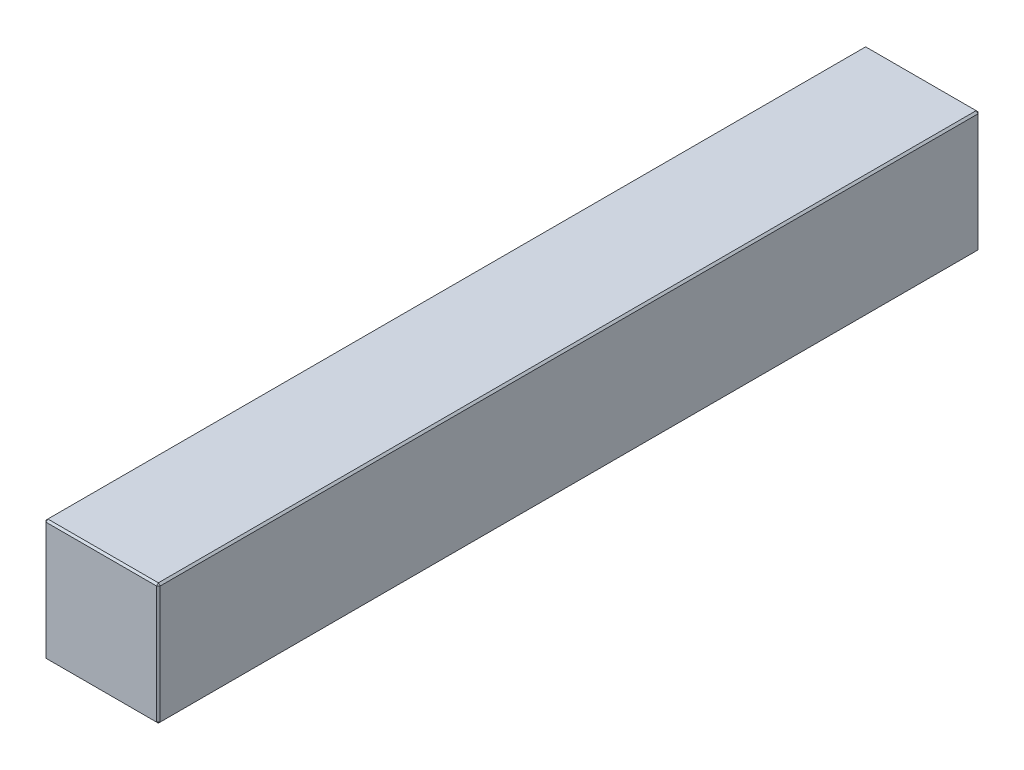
ISO-10303-21;
HEADER;
FILE_DESCRIPTION(('STEP AP214'),'2;1');
FILE_NAME('part.step','',(''),(''),'','','');
FILE_SCHEMA(('AUTOMOTIVE_DESIGN { 1 0 10303 214 1 1 1 1 }'));
ENDSEC;
DATA;
#1=APPLICATION_CONTEXT('core data for automotive mechanical design processes');
#2=APPLICATION_PROTOCOL_DEFINITION('international standard','automotive_design',2000,#1);
#3=PRODUCT_CONTEXT('',#1,'mechanical');
#4=PRODUCT('Part','Part','',(#3));
#5=PRODUCT_RELATED_PRODUCT_CATEGORY('part','',(#4));
#6=PRODUCT_DEFINITION_FORMATION('','',#4);
#7=PRODUCT_DEFINITION_CONTEXT('part definition',#1,'design');
#8=PRODUCT_DEFINITION('design','',#6,#7);
#9=PRODUCT_DEFINITION_SHAPE('','',#8);
#10=(LENGTH_UNIT() NAMED_UNIT(*) SI_UNIT(.MILLI.,.METRE.));
#11=(NAMED_UNIT(*) PLANE_ANGLE_UNIT() SI_UNIT($,.RADIAN.));
#12=(NAMED_UNIT(*) SI_UNIT($,.STERADIAN.) SOLID_ANGLE_UNIT());
#13=UNCERTAINTY_MEASURE_WITH_UNIT(LENGTH_MEASURE(1.E-05),#10,'distance_accuracy_value','');
#14=(GEOMETRIC_REPRESENTATION_CONTEXT(3) GLOBAL_UNCERTAINTY_ASSIGNED_CONTEXT((#13)) GLOBAL_UNIT_ASSIGNED_CONTEXT((#10,
#11,#12)) REPRESENTATION_CONTEXT('',''));
#15=CARTESIAN_POINT('',(0.,0.,0.));
#16=DIRECTION('',(0.,0.,1.));
#17=DIRECTION('',(1.,0.,0.));
#18=AXIS2_PLACEMENT_3D('',#15,#16,#17);
#19=CARTESIAN_POINT('',(-31.,66.,223.));
#20=DIRECTION('',(1.,0.,0.));
#21=DIRECTION('',(0.,0.,-1.));
#22=AXIS2_PLACEMENT_3D('',#19,#20,#21);
#23=PLANE('',#22);
#24=DIRECTION('',(0.,-1.,0.));
#25=VECTOR('',#24,1.);
#26=CARTESIAN_POINT('',(-31.,66.,-222.));
#27=LINE('',#26,#25);
#28=CARTESIAN_POINT('',(-31.,65.,-222.));
#29=VERTEX_POINT('',#28);
#30=CARTESIAN_POINT('',(-31.,1.00000000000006,-222.));
#31=VERTEX_POINT('',#30);
#32=EDGE_CURVE('E115',#29,#31,#27,.T.);
#33=ORIENTED_EDGE('',*,*,#32,.T.);
#34=DIRECTION('',(0.,0.,1.));
#35=VECTOR('',#34,1.);
#36=CARTESIAN_POINT('',(-31.,1.00000000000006,223.));
#37=LINE('',#36,#35);
#38=CARTESIAN_POINT('',(-31.,1.00000000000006,222.));
#39=VERTEX_POINT('',#38);
#40=EDGE_CURVE('E111',#31,#39,#37,.T.);
#41=ORIENTED_EDGE('',*,*,#40,.T.);
#42=DIRECTION('',(0.,1.,0.));
#43=VECTOR('',#42,1.);
#44=CARTESIAN_POINT('',(-31.,66.,222.));
#45=LINE('',#44,#43);
#46=CARTESIAN_POINT('',(-31.,65.,222.));
#47=VERTEX_POINT('',#46);
#48=EDGE_CURVE('E104',#39,#47,#45,.T.);
#49=ORIENTED_EDGE('',*,*,#48,.T.);
#50=DIRECTION('',(0.,0.,-1.));
#51=VECTOR('',#50,1.);
#52=CARTESIAN_POINT('',(-31.,65.,-223.));
#53=LINE('',#52,#51);
#54=EDGE_CURVE('E108',#47,#29,#53,.T.);
#55=ORIENTED_EDGE('',*,*,#54,.T.);
#56=EDGE_LOOP('',(#33,#41,#49,#55));
#57=FACE_BOUND('',#56,.T.);
#58=ADVANCED_FACE('F16',(#57),#23,.F.);
#59=CARTESIAN_POINT('',(31.,66.,223.));
#60=DIRECTION('',(0.,0.,-1.));
#61=DIRECTION('',(-1.,0.,0.));
#62=AXIS2_PLACEMENT_3D('',#59,#60,#61);
#63=PLANE('',#62);
#64=DIRECTION('',(-1.,0.,0.));
#65=VECTOR('',#64,1.);
#66=CARTESIAN_POINT('',(-31.,65.,223.));
#67=LINE('',#66,#65);
#68=CARTESIAN_POINT('',(30.,65.,223.));
#69=VERTEX_POINT('',#68);
#70=CARTESIAN_POINT('',(-30.,65.,223.));
#71=VERTEX_POINT('',#70);
#72=EDGE_CURVE('E165',#69,#71,#67,.T.);
#73=ORIENTED_EDGE('',*,*,#72,.T.);
#74=DIRECTION('',(0.,-1.,0.));
#75=VECTOR('',#74,1.);
#76=CARTESIAN_POINT('',(-30.,66.,223.));
#77=LINE('',#76,#75);
#78=CARTESIAN_POINT('',(-30.,1.00000000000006,223.));
#79=VERTEX_POINT('',#78);
#80=EDGE_CURVE('E123',#71,#79,#77,.T.);
#81=ORIENTED_EDGE('',*,*,#80,.T.);
#82=DIRECTION('',(1.,0.,0.));
#83=VECTOR('',#82,1.);
#84=CARTESIAN_POINT('',(31.,1.00000000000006,223.));
#85=LINE('',#84,#83);
#86=CARTESIAN_POINT('',(30.,1.00000000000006,223.));
#87=VERTEX_POINT('',#86);
#88=EDGE_CURVE('E169',#79,#87,#85,.T.);
#89=ORIENTED_EDGE('',*,*,#88,.T.);
#90=DIRECTION('',(0.,1.,0.));
#91=VECTOR('',#90,1.);
#92=CARTESIAN_POINT('',(30.,66.,223.));
#93=LINE('',#92,#91);
#94=EDGE_CURVE('E167',#87,#69,#93,.T.);
#95=ORIENTED_EDGE('',*,*,#94,.T.);
#96=EDGE_LOOP('',(#73,#81,#89,#95));
#97=FACE_BOUND('',#96,.T.);
#98=ADVANCED_FACE('F276',(#97),#63,.F.);
#99=CARTESIAN_POINT('',(31.,66.,223.));
#100=DIRECTION('',(-1.,0.,0.));
#101=DIRECTION('',(0.,0.,1.));
#102=AXIS2_PLACEMENT_3D('',#99,#100,#101);
#103=PLANE('',#102);
#104=DIRECTION('',(0.,0.,-1.));
#105=VECTOR('',#104,1.);
#106=CARTESIAN_POINT('',(31.,1.00000000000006,223.));
#107=LINE('',#106,#105);
#108=CARTESIAN_POINT('',(31.,1.00000000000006,222.));
#109=VERTEX_POINT('',#108);
#110=CARTESIAN_POINT('',(31.,1.00000000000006,-222.));
#111=VERTEX_POINT('',#110);
#112=EDGE_CURVE('E160',#109,#111,#107,.T.);
#113=ORIENTED_EDGE('',*,*,#112,.T.);
#114=DIRECTION('',(0.,1.,0.));
#115=VECTOR('',#114,1.);
#116=CARTESIAN_POINT('',(31.,66.,-222.));
#117=LINE('',#116,#115);
#118=CARTESIAN_POINT('',(31.,65.,-222.));
#119=VERTEX_POINT('',#118);
#120=EDGE_CURVE('E162',#111,#119,#117,.T.);
#121=ORIENTED_EDGE('',*,*,#120,.T.);
#122=DIRECTION('',(0.,0.,1.));
#123=VECTOR('',#122,1.);
#124=CARTESIAN_POINT('',(31.,65.,223.));
#125=LINE('',#124,#123);
#126=CARTESIAN_POINT('',(31.,65.,222.));
#127=VERTEX_POINT('',#126);
#128=EDGE_CURVE('E156',#119,#127,#125,.T.);
#129=ORIENTED_EDGE('',*,*,#128,.T.);
#130=DIRECTION('',(0.,-1.,0.));
#131=VECTOR('',#130,1.);
#132=CARTESIAN_POINT('',(31.,66.,222.));
#133=LINE('',#132,#131);
#134=EDGE_CURVE('E158',#127,#109,#133,.T.);
#135=ORIENTED_EDGE('',*,*,#134,.T.);
#136=EDGE_LOOP('',(#113,#121,#129,#135));
#137=FACE_BOUND('',#136,.T.);
#138=ADVANCED_FACE('F255',(#137),#103,.F.);
#139=CARTESIAN_POINT('',(31.,66.,-223.));
#140=DIRECTION('',(0.,0.,1.));
#141=DIRECTION('',(1.,0.,0.));
#142=AXIS2_PLACEMENT_3D('',#139,#140,#141);
#143=PLANE('',#142);
#144=DIRECTION('',(0.,-1.,0.));
#145=VECTOR('',#144,1.);
#146=CARTESIAN_POINT('',(30.,66.,-223.));
#147=LINE('',#146,#145);
#148=CARTESIAN_POINT('',(30.,65.,-223.));
#149=VERTEX_POINT('',#148);
#150=CARTESIAN_POINT('',(30.,1.00000000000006,-223.));
#151=VERTEX_POINT('',#150);
#152=EDGE_CURVE('E149',#149,#151,#147,.T.);
#153=ORIENTED_EDGE('',*,*,#152,.T.);
#154=DIRECTION('',(-1.,0.,0.));
#155=VECTOR('',#154,1.);
#156=CARTESIAN_POINT('',(31.,1.00000000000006,-223.));
#157=LINE('',#156,#155);
#158=CARTESIAN_POINT('',(-30.,1.00000000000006,-223.));
#159=VERTEX_POINT('',#158);
#160=EDGE_CURVE('E154',#151,#159,#157,.T.);
#161=ORIENTED_EDGE('',*,*,#160,.T.);
#162=DIRECTION('',(0.,1.,0.));
#163=VECTOR('',#162,1.);
#164=CARTESIAN_POINT('',(-30.,66.,-223.));
#165=LINE('',#164,#163);
#166=CARTESIAN_POINT('',(-30.,65.,-223.));
#167=VERTEX_POINT('',#166);
#168=EDGE_CURVE('E151',#159,#167,#165,.T.);
#169=ORIENTED_EDGE('',*,*,#168,.T.);
#170=DIRECTION('',(1.,0.,0.));
#171=VECTOR('',#170,1.);
#172=CARTESIAN_POINT('',(31.,65.,-223.));
#173=LINE('',#172,#171);
#174=EDGE_CURVE('E147',#167,#149,#173,.T.);
#175=ORIENTED_EDGE('',*,*,#174,.T.);
#176=EDGE_LOOP('',(#153,#161,#169,#175));
#177=FACE_BOUND('',#176,.T.);
#178=ADVANCED_FACE('F285',(#177),#143,.F.);
#179=CARTESIAN_POINT('',(0.,66.,0.));
#180=DIRECTION('',(0.,1.,0.));
#181=DIRECTION('',(0.,0.,1.));
#182=AXIS2_PLACEMENT_3D('',#179,#180,#181);
#183=PLANE('',#182);
#184=DIRECTION('',(0.,0.,-1.));
#185=VECTOR('',#184,1.);
#186=CARTESIAN_POINT('',(30.,66.,-223.));
#187=LINE('',#186,#185);
#188=CARTESIAN_POINT('',(30.,66.,222.));
#189=VERTEX_POINT('',#188);
#190=CARTESIAN_POINT('',(30.,66.,-222.));
#191=VERTEX_POINT('',#190);
#192=EDGE_CURVE('E25',#189,#191,#187,.T.);
#193=ORIENTED_EDGE('',*,*,#192,.T.);
#194=DIRECTION('',(-1.,0.,0.));
#195=VECTOR('',#194,1.);
#196=CARTESIAN_POINT('',(-31.,66.,-222.));
#197=LINE('',#196,#195);
#198=CARTESIAN_POINT('',(-30.,66.,-222.));
#199=VERTEX_POINT('',#198);
#200=EDGE_CURVE('E10',#191,#199,#197,.T.);
#201=ORIENTED_EDGE('',*,*,#200,.T.);
#202=DIRECTION('',(0.,0.,1.));
#203=VECTOR('',#202,1.);
#204=CARTESIAN_POINT('',(-30.,66.,223.));
#205=LINE('',#204,#203);
#206=CARTESIAN_POINT('',(-30.,66.,222.));
#207=VERTEX_POINT('',#206);
#208=EDGE_CURVE('E181',#199,#207,#205,.T.);
#209=ORIENTED_EDGE('',*,*,#208,.T.);
#210=DIRECTION('',(1.,0.,0.));
#211=VECTOR('',#210,1.);
#212=CARTESIAN_POINT('',(31.,66.,222.));
#213=LINE('',#212,#211);
#214=EDGE_CURVE('E36',#207,#189,#213,.T.);
#215=ORIENTED_EDGE('',*,*,#214,.T.);
#216=EDGE_LOOP('',(#193,#201,#209,#215));
#217=FACE_BOUND('',#216,.T.);
#218=ADVANCED_FACE('F351',(#217),#183,.T.);
#219=CARTESIAN_POINT('',(0.,0.,0.));
#220=DIRECTION('',(0.,1.,0.));
#221=DIRECTION('',(0.,0.,1.));
#222=AXIS2_PLACEMENT_3D('',#219,#220,#221);
#223=PLANE('',#222);
#224=DIRECTION('',(0.,0.,1.));
#225=VECTOR('',#224,1.);
#226=CARTESIAN_POINT('',(30.,0.,0.));
#227=LINE('',#226,#225);
#228=CARTESIAN_POINT('',(30.,0.,-222.));
#229=VERTEX_POINT('',#228);
#230=CARTESIAN_POINT('',(30.,0.,222.));
#231=VERTEX_POINT('',#230);
#232=EDGE_CURVE('E172',#229,#231,#227,.T.);
#233=ORIENTED_EDGE('',*,*,#232,.T.);
#234=DIRECTION('',(-1.,0.,0.));
#235=VECTOR('',#234,1.);
#236=CARTESIAN_POINT('',(0.,0.,222.));
#237=LINE('',#236,#235);
#238=CARTESIAN_POINT('',(-30.,0.,222.));
#239=VERTEX_POINT('',#238);
#240=EDGE_CURVE('E178',#231,#239,#237,.T.);
#241=ORIENTED_EDGE('',*,*,#240,.T.);
#242=DIRECTION('',(0.,0.,-1.));
#243=VECTOR('',#242,1.);
#244=CARTESIAN_POINT('',(-30.,0.,0.));
#245=LINE('',#244,#243);
#246=CARTESIAN_POINT('',(-30.,0.,-222.));
#247=VERTEX_POINT('',#246);
#248=EDGE_CURVE('E176',#239,#247,#245,.T.);
#249=ORIENTED_EDGE('',*,*,#248,.T.);
#250=DIRECTION('',(1.,0.,0.));
#251=VECTOR('',#250,1.);
#252=CARTESIAN_POINT('',(0.,0.,-222.));
#253=LINE('',#252,#251);
#254=EDGE_CURVE('E174',#247,#229,#253,.T.);
#255=ORIENTED_EDGE('',*,*,#254,.T.);
#256=EDGE_LOOP('',(#233,#241,#249,#255));
#257=FACE_BOUND('',#256,.T.);
#258=ADVANCED_FACE('F247',(#257),#223,.F.);
#259=CARTESIAN_POINT('',(31.,66.,222.));
#260=DIRECTION('',(-0.707106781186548,0.,-0.707106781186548));
#261=DIRECTION('',(0.,-1.,0.));
#262=AXIS2_PLACEMENT_3D('',#259,#260,#261);
#263=PLANE('',#262);
#264=DIRECTION('',(-0.707106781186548,0.,0.707106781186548));
#265=VECTOR('',#264,1.);
#266=CARTESIAN_POINT('',(30.,65.,223.));
#267=LINE('',#266,#265);
#268=EDGE_CURVE('E20',#69,#127,#267,.F.);
#269=ORIENTED_EDGE('',*,*,#268,.F.);
#270=ORIENTED_EDGE('',*,*,#94,.F.);
#271=DIRECTION('',(0.707106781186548,0.,-0.707106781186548));
#272=VECTOR('',#271,1.);
#273=CARTESIAN_POINT('',(30.,1.00000000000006,223.));
#274=LINE('',#273,#272);
#275=EDGE_CURVE('E143',#109,#87,#274,.F.);
#276=ORIENTED_EDGE('',*,*,#275,.F.);
#277=ORIENTED_EDGE('',*,*,#134,.F.);
#278=EDGE_LOOP('',(#269,#270,#276,#277));
#279=FACE_BOUND('',#278,.T.);
#280=ADVANCED_FACE('F18',(#279),#263,.F.);
#281=CARTESIAN_POINT('',(30.,65.,223.));
#282=DIRECTION('',(0.577350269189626,0.577350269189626,0.577350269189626));
#283=DIRECTION('',(0.707106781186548,0.,-0.707106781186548));
#284=AXIS2_PLACEMENT_3D('',#281,#282,#283);
#285=PLANE('',#284);
#286=DIRECTION('',(0.,-0.707106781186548,0.707106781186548));
#287=VECTOR('',#286,1.);
#288=CARTESIAN_POINT('',(30.,65.,223.));
#289=LINE('',#288,#287);
#290=EDGE_CURVE('E227',#69,#189,#289,.F.);
#291=ORIENTED_EDGE('',*,*,#290,.F.);
#292=ORIENTED_EDGE('',*,*,#268,.T.);
#293=DIRECTION('',(-0.707106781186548,0.707106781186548,0.));
#294=VECTOR('',#293,1.);
#295=CARTESIAN_POINT('',(30.5,65.5,222.));
#296=LINE('',#295,#294);
#297=EDGE_CURVE('E229',#189,#127,#296,.F.);
#298=ORIENTED_EDGE('',*,*,#297,.F.);
#299=EDGE_LOOP('',(#291,#292,#298));
#300=FACE_BOUND('',#299,.T.);
#301=ADVANCED_FACE('F271',(#300),#285,.T.);
#302=CARTESIAN_POINT('',(30.,1.00000000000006,223.));
#303=DIRECTION('',(0.577350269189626,-0.577350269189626,0.577350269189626));
#304=DIRECTION('',(0.707106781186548,0.,-0.707106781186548));
#305=AXIS2_PLACEMENT_3D('',#302,#303,#304);
#306=PLANE('',#305);
#307=DIRECTION('',(-0.707106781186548,-0.707106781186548,0.));
#308=VECTOR('',#307,1.);
#309=CARTESIAN_POINT('',(30.5,0.500000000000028,222.));
#310=LINE('',#309,#308);
#311=EDGE_CURVE('E221',#109,#231,#310,.T.);
#312=ORIENTED_EDGE('',*,*,#311,.F.);
#313=ORIENTED_EDGE('',*,*,#275,.T.);
#314=DIRECTION('',(0.,0.707106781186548,0.707106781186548));
#315=VECTOR('',#314,1.);
#316=CARTESIAN_POINT('',(30.,1.00000000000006,223.));
#317=LINE('',#316,#315);
#318=EDGE_CURVE('E224',#231,#87,#317,.T.);
#319=ORIENTED_EDGE('',*,*,#318,.F.);
#320=EDGE_LOOP('',(#312,#313,#319));
#321=FACE_BOUND('',#320,.T.);
#322=ADVANCED_FACE('F236',(#321),#306,.T.);
#323=CARTESIAN_POINT('',(30.,66.,0.));
#324=DIRECTION('',(0.707106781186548,0.707106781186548,0.));
#325=DIRECTION('',(0.,0.,1.));
#326=AXIS2_PLACEMENT_3D('',#323,#324,#325);
#327=PLANE('',#326);
#328=ORIENTED_EDGE('',*,*,#297,.T.);
#329=ORIENTED_EDGE('',*,*,#128,.F.);
#330=DIRECTION('',(0.707106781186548,-0.707106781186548,0.));
#331=VECTOR('',#330,1.);
#332=CARTESIAN_POINT('',(31.,65.,-222.));
#333=LINE('',#332,#331);
#334=EDGE_CURVE('E216',#191,#119,#333,.T.);
#335=ORIENTED_EDGE('',*,*,#334,.F.);
#336=ORIENTED_EDGE('',*,*,#192,.F.);
#337=EDGE_LOOP('',(#328,#329,#335,#336));
#338=FACE_BOUND('',#337,.T.);
#339=ADVANCED_FACE('F266',(#338),#327,.T.);
#340=CARTESIAN_POINT('',(0.,66.,222.));
#341=DIRECTION('',(0.,0.707106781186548,0.707106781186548));
#342=DIRECTION('',(-1.,0.,0.));
#343=AXIS2_PLACEMENT_3D('',#340,#341,#342);
#344=PLANE('',#343);
#345=ORIENTED_EDGE('',*,*,#290,.T.);
#346=ORIENTED_EDGE('',*,*,#214,.F.);
#347=DIRECTION('',(0.,0.707106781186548,-0.707106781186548));
#348=VECTOR('',#347,1.);
#349=CARTESIAN_POINT('',(-30.,65.5,222.5));
#350=LINE('',#349,#348);
#351=EDGE_CURVE('E127',#71,#207,#350,.T.);
#352=ORIENTED_EDGE('',*,*,#351,.F.);
#353=ORIENTED_EDGE('',*,*,#72,.F.);
#354=EDGE_LOOP('',(#345,#346,#352,#353));
#355=FACE_BOUND('',#354,.T.);
#356=ADVANCED_FACE('F274',(#355),#344,.T.);
#357=CARTESIAN_POINT('',(-30.,66.,223.));
#358=DIRECTION('',(0.707106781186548,0.,-0.707106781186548));
#359=DIRECTION('',(0.,-1.,0.));
#360=AXIS2_PLACEMENT_3D('',#357,#358,#359);
#361=PLANE('',#360);
#362=DIRECTION('',(0.707106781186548,0.,0.707106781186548));
#363=VECTOR('',#362,1.);
#364=CARTESIAN_POINT('',(-30.,1.00000000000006,223.));
#365=LINE('',#364,#363);
#366=EDGE_CURVE('E128',#79,#39,#365,.F.);
#367=ORIENTED_EDGE('',*,*,#366,.F.);
#368=ORIENTED_EDGE('',*,*,#80,.F.);
#369=DIRECTION('',(-0.707106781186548,0.,-0.707106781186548));
#370=VECTOR('',#369,1.);
#371=CARTESIAN_POINT('',(-31.,65.,222.));
#372=LINE('',#371,#370);
#373=EDGE_CURVE('E119',#47,#71,#372,.F.);
#374=ORIENTED_EDGE('',*,*,#373,.F.);
#375=ORIENTED_EDGE('',*,*,#48,.F.);
#376=EDGE_LOOP('',(#367,#368,#374,#375));
#377=FACE_BOUND('',#376,.T.);
#378=ADVANCED_FACE('F121',(#377),#361,.F.);
#379=CARTESIAN_POINT('',(31.,1.00000000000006,223.));
#380=DIRECTION('',(0.,0.707106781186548,-0.707106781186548));
#381=DIRECTION('',(1.,0.,0.));
#382=AXIS2_PLACEMENT_3D('',#379,#380,#381);
#383=PLANE('',#382);
#384=ORIENTED_EDGE('',*,*,#318,.T.);
#385=ORIENTED_EDGE('',*,*,#88,.F.);
#386=DIRECTION('',(0.,-0.707106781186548,-0.707106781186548));
#387=VECTOR('',#386,1.);
#388=CARTESIAN_POINT('',(-30.,1.00000000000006,223.));
#389=LINE('',#388,#387);
#390=EDGE_CURVE('E212',#239,#79,#389,.F.);
#391=ORIENTED_EDGE('',*,*,#390,.F.);
#392=ORIENTED_EDGE('',*,*,#240,.F.);
#393=EDGE_LOOP('',(#384,#385,#391,#392));
#394=FACE_BOUND('',#393,.T.);
#395=ADVANCED_FACE('F244',(#394),#383,.F.);
#396=CARTESIAN_POINT('',(31.,1.00000000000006,223.));
#397=DIRECTION('',(-0.707106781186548,0.707106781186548,0.));
#398=DIRECTION('',(0.,0.,-1.));
#399=AXIS2_PLACEMENT_3D('',#396,#397,#398);
#400=PLANE('',#399);
#401=ORIENTED_EDGE('',*,*,#311,.T.);
#402=ORIENTED_EDGE('',*,*,#232,.F.);
#403=DIRECTION('',(0.707106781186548,0.707106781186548,0.));
#404=VECTOR('',#403,1.);
#405=CARTESIAN_POINT('',(30.5,0.500000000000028,-222.));
#406=LINE('',#405,#404);
#407=EDGE_CURVE('E209',#111,#229,#406,.F.);
#408=ORIENTED_EDGE('',*,*,#407,.F.);
#409=ORIENTED_EDGE('',*,*,#112,.F.);
#410=EDGE_LOOP('',(#401,#402,#408,#409));
#411=FACE_BOUND('',#410,.T.);
#412=ADVANCED_FACE('F252',(#411),#400,.F.);
#413=CARTESIAN_POINT('',(30.,66.,-223.));
#414=DIRECTION('',(-0.707106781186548,0.,0.707106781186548));
#415=DIRECTION('',(0.,-1.,0.));
#416=AXIS2_PLACEMENT_3D('',#413,#414,#415);
#417=PLANE('',#416);
#418=DIRECTION('',(0.707106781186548,0.,0.707106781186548));
#419=VECTOR('',#418,1.);
#420=CARTESIAN_POINT('',(31.,65.,-222.));
#421=LINE('',#420,#419);
#422=EDGE_CURVE('E218',#119,#149,#421,.F.);
#423=ORIENTED_EDGE('',*,*,#422,.F.);
#424=ORIENTED_EDGE('',*,*,#120,.F.);
#425=DIRECTION('',(-0.707106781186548,0.,-0.707106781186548));
#426=VECTOR('',#425,1.);
#427=CARTESIAN_POINT('',(30.,1.00000000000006,-223.));
#428=LINE('',#427,#426);
#429=EDGE_CURVE('E206',#151,#111,#428,.F.);
#430=ORIENTED_EDGE('',*,*,#429,.F.);
#431=ORIENTED_EDGE('',*,*,#152,.F.);
#432=EDGE_LOOP('',(#423,#424,#430,#431));
#433=FACE_BOUND('',#432,.T.);
#434=ADVANCED_FACE('F259',(#433),#417,.F.);
#435=CARTESIAN_POINT('',(31.,65.,-222.));
#436=DIRECTION('',(0.577350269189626,0.577350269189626,-0.577350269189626));
#437=DIRECTION('',(-0.707106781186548,0.,-0.707106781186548));
#438=AXIS2_PLACEMENT_3D('',#435,#436,#437);
#439=PLANE('',#438);
#440=ORIENTED_EDGE('',*,*,#334,.T.);
#441=ORIENTED_EDGE('',*,*,#422,.T.);
#442=DIRECTION('',(0.,0.707106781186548,0.707106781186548));
#443=VECTOR('',#442,1.);
#444=CARTESIAN_POINT('',(30.,65.5,-222.5));
#445=LINE('',#444,#443);
#446=EDGE_CURVE('E135',#191,#149,#445,.F.);
#447=ORIENTED_EDGE('',*,*,#446,.F.);
#448=EDGE_LOOP('',(#440,#441,#447));
#449=FACE_BOUND('',#448,.T.);
#450=ADVANCED_FACE('F326',(#449),#439,.T.);
#451=CARTESIAN_POINT('',(-31.,65.,222.));
#452=DIRECTION('',(-0.577350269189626,0.577350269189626,0.577350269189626));
#453=DIRECTION('',(0.707106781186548,0.,0.707106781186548));
#454=AXIS2_PLACEMENT_3D('',#451,#452,#453);
#455=PLANE('',#454);
#456=ORIENTED_EDGE('',*,*,#373,.T.);
#457=ORIENTED_EDGE('',*,*,#351,.T.);
#458=DIRECTION('',(-0.707106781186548,-0.707106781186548,0.));
#459=VECTOR('',#458,1.);
#460=CARTESIAN_POINT('',(-31.,65.,222.));
#461=LINE('',#460,#459);
#462=EDGE_CURVE('E131',#47,#207,#461,.F.);
#463=ORIENTED_EDGE('',*,*,#462,.F.);
#464=EDGE_LOOP('',(#456,#457,#463));
#465=FACE_BOUND('',#464,.T.);
#466=ADVANCED_FACE('F132',(#465),#455,.T.);
#467=CARTESIAN_POINT('',(-30.,1.00000000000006,223.));
#468=DIRECTION('',(-0.577350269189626,-0.577350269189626,0.577350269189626));
#469=DIRECTION('',(0.707106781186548,0.,0.707106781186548));
#470=AXIS2_PLACEMENT_3D('',#467,#468,#469);
#471=PLANE('',#470);
#472=ORIENTED_EDGE('',*,*,#390,.T.);
#473=ORIENTED_EDGE('',*,*,#366,.T.);
#474=DIRECTION('',(-0.707106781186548,0.707106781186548,0.));
#475=VECTOR('',#474,1.);
#476=CARTESIAN_POINT('',(-30.5,0.500000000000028,222.));
#477=LINE('',#476,#475);
#478=EDGE_CURVE('E136',#239,#39,#477,.T.);
#479=ORIENTED_EDGE('',*,*,#478,.F.);
#480=EDGE_LOOP('',(#472,#473,#479));
#481=FACE_BOUND('',#480,.T.);
#482=ADVANCED_FACE('F319',(#481),#471,.T.);
#483=CARTESIAN_POINT('',(30.,1.00000000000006,-223.));
#484=DIRECTION('',(0.577350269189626,-0.577350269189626,-0.577350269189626));
#485=DIRECTION('',(-0.707106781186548,0.,-0.707106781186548));
#486=AXIS2_PLACEMENT_3D('',#483,#484,#485);
#487=PLANE('',#486);
#488=ORIENTED_EDGE('',*,*,#429,.T.);
#489=ORIENTED_EDGE('',*,*,#407,.T.);
#490=DIRECTION('',(0.,-0.707106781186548,0.707106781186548));
#491=VECTOR('',#490,1.);
#492=CARTESIAN_POINT('',(30.,1.00000000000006,-223.));
#493=LINE('',#492,#491);
#494=EDGE_CURVE('E199',#151,#229,#493,.T.);
#495=ORIENTED_EDGE('',*,*,#494,.F.);
#496=EDGE_LOOP('',(#488,#489,#495));
#497=FACE_BOUND('',#496,.T.);
#498=ADVANCED_FACE('F315',(#497),#487,.T.);
#499=CARTESIAN_POINT('',(0.,66.,-222.));
#500=DIRECTION('',(0.,0.707106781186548,-0.707106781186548));
#501=DIRECTION('',(1.,0.,0.));
#502=AXIS2_PLACEMENT_3D('',#499,#500,#501);
#503=PLANE('',#502);
#504=ORIENTED_EDGE('',*,*,#446,.T.);
#505=ORIENTED_EDGE('',*,*,#174,.F.);
#506=DIRECTION('',(0.,-0.707106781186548,-0.707106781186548));
#507=VECTOR('',#506,1.);
#508=CARTESIAN_POINT('',(-30.,65.,-223.));
#509=LINE('',#508,#507);
#510=EDGE_CURVE('E196',#199,#167,#509,.T.);
#511=ORIENTED_EDGE('',*,*,#510,.F.);
#512=ORIENTED_EDGE('',*,*,#200,.F.);
#513=EDGE_LOOP('',(#504,#505,#511,#512));
#514=FACE_BOUND('',#513,.T.);
#515=ADVANCED_FACE('F312',(#514),#503,.T.);
#516=CARTESIAN_POINT('',(-30.,66.,0.));
#517=DIRECTION('',(-0.707106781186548,0.707106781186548,0.));
#518=DIRECTION('',(0.,0.,-1.));
#519=AXIS2_PLACEMENT_3D('',#516,#517,#518);
#520=PLANE('',#519);
#521=ORIENTED_EDGE('',*,*,#462,.T.);
#522=ORIENTED_EDGE('',*,*,#208,.F.);
#523=DIRECTION('',(0.707106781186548,0.707106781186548,0.));
#524=VECTOR('',#523,1.);
#525=CARTESIAN_POINT('',(-30.5,65.5,-222.));
#526=LINE('',#525,#524);
#527=EDGE_CURVE('E139',#29,#199,#526,.T.);
#528=ORIENTED_EDGE('',*,*,#527,.F.);
#529=ORIENTED_EDGE('',*,*,#54,.F.);
#530=EDGE_LOOP('',(#521,#522,#528,#529));
#531=FACE_BOUND('',#530,.T.);
#532=ADVANCED_FACE('F138',(#531),#520,.T.);
#533=CARTESIAN_POINT('',(-31.,1.00000000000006,223.));
#534=DIRECTION('',(0.707106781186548,0.707106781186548,0.));
#535=DIRECTION('',(0.,0.,1.));
#536=AXIS2_PLACEMENT_3D('',#533,#534,#535);
#537=PLANE('',#536);
#538=ORIENTED_EDGE('',*,*,#478,.T.);
#539=ORIENTED_EDGE('',*,*,#40,.F.);
#540=DIRECTION('',(0.707106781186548,-0.707106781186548,0.));
#541=VECTOR('',#540,1.);
#542=CARTESIAN_POINT('',(-31.,1.00000000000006,-222.));
#543=LINE('',#542,#541);
#544=EDGE_CURVE('E192',#247,#31,#543,.F.);
#545=ORIENTED_EDGE('',*,*,#544,.F.);
#546=ORIENTED_EDGE('',*,*,#248,.F.);
#547=EDGE_LOOP('',(#538,#539,#545,#546));
#548=FACE_BOUND('',#547,.T.);
#549=ADVANCED_FACE('F305',(#548),#537,.F.);
#550=CARTESIAN_POINT('',(31.,1.00000000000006,-223.));
#551=DIRECTION('',(0.,0.707106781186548,0.707106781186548));
#552=DIRECTION('',(-1.,0.,0.));
#553=AXIS2_PLACEMENT_3D('',#550,#551,#552);
#554=PLANE('',#553);
#555=ORIENTED_EDGE('',*,*,#494,.T.);
#556=ORIENTED_EDGE('',*,*,#254,.F.);
#557=DIRECTION('',(0.,0.707106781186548,-0.707106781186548));
#558=VECTOR('',#557,1.);
#559=CARTESIAN_POINT('',(-30.,0.500000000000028,-222.5));
#560=LINE('',#559,#558);
#561=EDGE_CURVE('E189',#159,#247,#560,.F.);
#562=ORIENTED_EDGE('',*,*,#561,.F.);
#563=ORIENTED_EDGE('',*,*,#160,.F.);
#564=EDGE_LOOP('',(#555,#556,#562,#563));
#565=FACE_BOUND('',#564,.T.);
#566=ADVANCED_FACE('F301',(#565),#554,.F.);
#567=CARTESIAN_POINT('',(-30.,65.,-223.));
#568=DIRECTION('',(-0.577350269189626,0.577350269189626,-0.577350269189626));
#569=DIRECTION('',(-0.707106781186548,0.,0.707106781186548));
#570=AXIS2_PLACEMENT_3D('',#567,#568,#569);
#571=PLANE('',#570);
#572=ORIENTED_EDGE('',*,*,#527,.T.);
#573=ORIENTED_EDGE('',*,*,#510,.T.);
#574=DIRECTION('',(0.707106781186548,0.,-0.707106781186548));
#575=VECTOR('',#574,1.);
#576=CARTESIAN_POINT('',(-30.,65.,-223.));
#577=LINE('',#576,#575);
#578=EDGE_CURVE('E187',#29,#167,#577,.T.);
#579=ORIENTED_EDGE('',*,*,#578,.F.);
#580=EDGE_LOOP('',(#572,#573,#579));
#581=FACE_BOUND('',#580,.T.);
#582=ADVANCED_FACE('F297',(#581),#571,.T.);
#583=CARTESIAN_POINT('',(-31.,1.00000000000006,-222.));
#584=DIRECTION('',(-0.577350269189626,-0.577350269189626,-0.577350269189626));
#585=DIRECTION('',(-0.707106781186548,0.,0.707106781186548));
#586=AXIS2_PLACEMENT_3D('',#583,#584,#585);
#587=PLANE('',#586);
#588=ORIENTED_EDGE('',*,*,#561,.T.);
#589=ORIENTED_EDGE('',*,*,#544,.T.);
#590=DIRECTION('',(-0.707106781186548,0.,0.707106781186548));
#591=VECTOR('',#590,1.);
#592=CARTESIAN_POINT('',(-31.,1.00000000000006,-222.));
#593=LINE('',#592,#591);
#594=EDGE_CURVE('E185',#159,#31,#593,.T.);
#595=ORIENTED_EDGE('',*,*,#594,.F.);
#596=EDGE_LOOP('',(#588,#589,#595));
#597=FACE_BOUND('',#596,.T.);
#598=ADVANCED_FACE('F293',(#597),#587,.T.);
#599=CARTESIAN_POINT('',(-31.,66.,-222.));
#600=DIRECTION('',(0.707106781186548,0.,0.707106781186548));
#601=DIRECTION('',(0.,-1.,0.));
#602=AXIS2_PLACEMENT_3D('',#599,#600,#601);
#603=PLANE('',#602);
#604=ORIENTED_EDGE('',*,*,#578,.T.);
#605=ORIENTED_EDGE('',*,*,#168,.F.);
#606=ORIENTED_EDGE('',*,*,#594,.T.);
#607=ORIENTED_EDGE('',*,*,#32,.F.);
#608=EDGE_LOOP('',(#604,#605,#606,#607));
#609=FACE_BOUND('',#608,.T.);
#610=ADVANCED_FACE('F290',(#609),#603,.F.);
#611=CLOSED_SHELL('',(#58,#98,#138,#178,#218,#258,#280,#301,#322,#339,#356,#378,#395,#412,#434,
#450,#466,#482,#498,#515,#532,#549,#566,#582,#598,#610));
#612=MANIFOLD_SOLID_BREP('B1',#611);
#613=ADVANCED_BREP_SHAPE_REPRESENTATION('',(#18,#612),#14);
#614=SHAPE_DEFINITION_REPRESENTATION(#9,#613);
ENDSEC;
END-ISO-10303-21;
